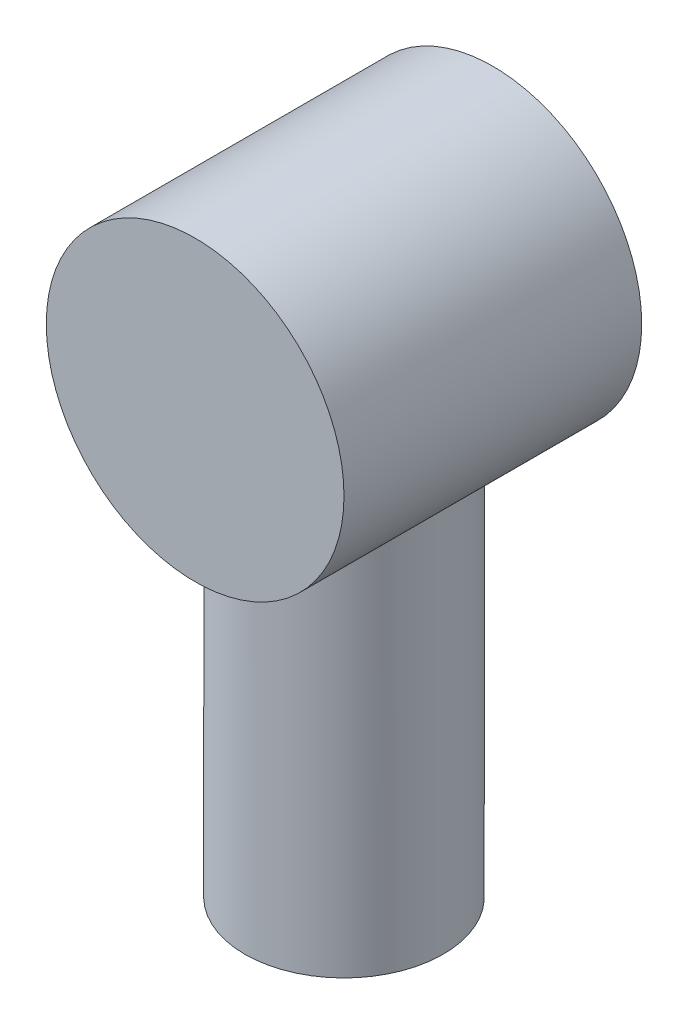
from build123d import *

# Parameters (mm, degrees)
BOSS_EXTRU_1_DEPTH      = 75
BOSS_EXTRU_1_DEPTH_BACK = 75
ESQUISSE1_R             = 75
ESQUISSE2_R             = 50
BOSS_EXTRU_2_DEPTH      = 250


with BuildPart() as part:
    # Esquisse1 → Boss.-Extru.1 (new, two sides: drawn at the far end of the back side and taken through both)
    with BuildSketch(Plane.XY.offset(-BOSS_EXTRU_1_DEPTH_BACK)):
        Circle(ESQUISSE1_R)
    extrude(amount=BOSS_EXTRU_1_DEPTH + BOSS_EXTRU_1_DEPTH_BACK)

    # Esquisse2 → Boss.-Extru.2 (add)
    with BuildSketch(Plane(origin=(0, 0, 0), x_dir=(1, 0, 0), z_dir=(0, 1, 0))):
        with Locations(Location((0, 0, 0), (0, 0, 270))):
            Circle(ESQUISSE2_R)
    extrude(amount=-BOSS_EXTRU_2_DEPTH)


solid = part.part
